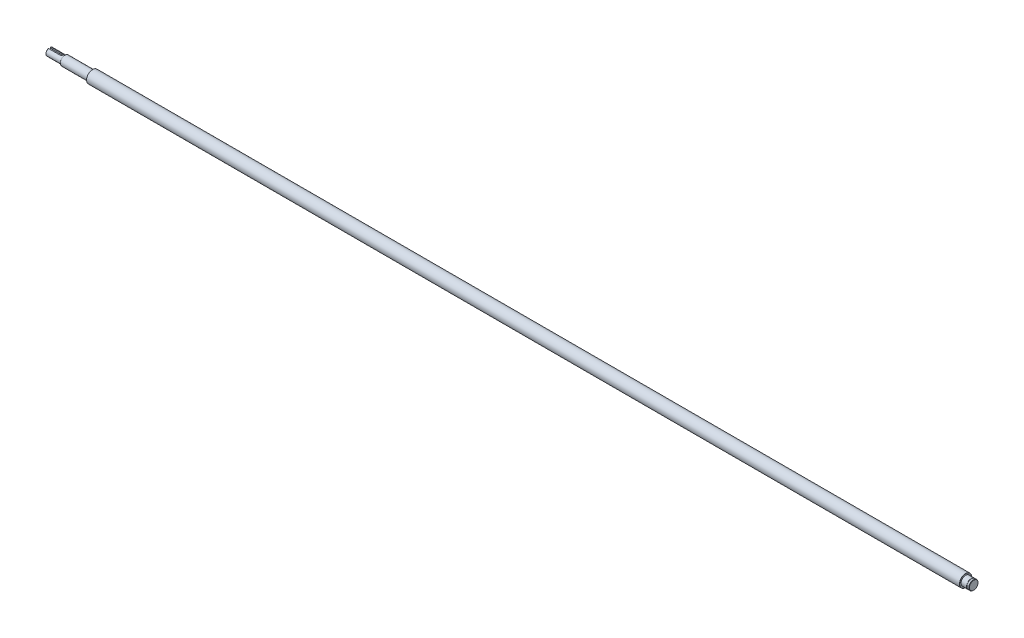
ISO-10303-21;
HEADER;
FILE_DESCRIPTION(('STEP AP214'),'2;1');
FILE_NAME('part.step','',(''),(''),'','','');
FILE_SCHEMA(('AUTOMOTIVE_DESIGN { 1 0 10303 214 1 1 1 1 }'));
ENDSEC;
DATA;
#1=APPLICATION_CONTEXT('core data for automotive mechanical design processes');
#2=APPLICATION_PROTOCOL_DEFINITION('international standard','automotive_design',2000,#1);
#3=PRODUCT_CONTEXT('',#1,'mechanical');
#4=PRODUCT('Part','Part','',(#3));
#5=PRODUCT_RELATED_PRODUCT_CATEGORY('part','',(#4));
#6=PRODUCT_DEFINITION_FORMATION('','',#4);
#7=PRODUCT_DEFINITION_CONTEXT('part definition',#1,'design');
#8=PRODUCT_DEFINITION('design','',#6,#7);
#9=PRODUCT_DEFINITION_SHAPE('','',#8);
#10=(LENGTH_UNIT() NAMED_UNIT(*) SI_UNIT(.MILLI.,.METRE.));
#11=(NAMED_UNIT(*) PLANE_ANGLE_UNIT() SI_UNIT($,.RADIAN.));
#12=(NAMED_UNIT(*) SI_UNIT($,.STERADIAN.) SOLID_ANGLE_UNIT());
#13=UNCERTAINTY_MEASURE_WITH_UNIT(LENGTH_MEASURE(1.E-05),#10,'distance_accuracy_value','');
#14=(GEOMETRIC_REPRESENTATION_CONTEXT(3) GLOBAL_UNCERTAINTY_ASSIGNED_CONTEXT((#13)) GLOBAL_UNIT_ASSIGNED_CONTEXT((#10,
#11,#12)) REPRESENTATION_CONTEXT('',''));
#15=CARTESIAN_POINT('',(0.,0.,0.));
#16=DIRECTION('',(0.,0.,1.));
#17=DIRECTION('',(1.,0.,0.));
#18=AXIS2_PLACEMENT_3D('',#15,#16,#17);
#19=CARTESIAN_POINT('',(0.,0.,0.));
#20=DIRECTION('',(1.,0.,0.));
#21=DIRECTION('',(0.,0.,-1.));
#22=AXIS2_PLACEMENT_3D('',#19,#20,#21);
#23=PLANE('',#22);
#24=DIRECTION('',(0.,-1.,0.));
#25=VECTOR('',#24,1.);
#26=CARTESIAN_POINT('',(0.,7.5,-2.));
#27=LINE('',#26,#25);
#28=CARTESIAN_POINT('',(0.,5.12347538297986,-2.));
#29=VERTEX_POINT('',#28);
#30=CARTESIAN_POINT('',(0.,3.5,-2.));
#31=VERTEX_POINT('',#30);
#32=EDGE_CURVE('E122',#29,#31,#27,.T.);
#33=ORIENTED_EDGE('',*,*,#32,.F.);
#34=CARTESIAN_POINT('',(0.,0.,0.));
#35=DIRECTION('',(1.,0.,0.));
#36=DIRECTION('',(0.,0.,-1.));
#37=AXIS2_PLACEMENT_3D('',#34,#35,#36);
#38=CIRCLE('',#37,5.50000000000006);
#39=CARTESIAN_POINT('',(0.,5.12347538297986,2.));
#40=VERTEX_POINT('',#39);
#41=EDGE_CURVE('E190',#29,#40,#38,.F.);
#42=ORIENTED_EDGE('',*,*,#41,.T.);
#43=DIRECTION('',(0.,-1.,0.));
#44=VECTOR('',#43,1.);
#45=CARTESIAN_POINT('',(0.,7.5,2.));
#46=LINE('',#45,#44);
#47=CARTESIAN_POINT('',(0.,3.5,2.));
#48=VERTEX_POINT('',#47);
#49=EDGE_CURVE('E81',#40,#48,#46,.T.);
#50=ORIENTED_EDGE('',*,*,#49,.T.);
#51=DIRECTION('',(0.,0.,1.));
#52=VECTOR('',#51,1.);
#53=CARTESIAN_POINT('',(0.,3.5,2.));
#54=LINE('',#53,#52);
#55=EDGE_CURVE('E131',#31,#48,#54,.T.);
#56=ORIENTED_EDGE('',*,*,#55,.F.);
#57=EDGE_LOOP('',(#33,#42,#50,#56));
#58=FACE_BOUND('',#57,.T.);
#59=ADVANCED_FACE('F58',(#58),#23,.F.);
#60=CARTESIAN_POINT('',(0.,0.,0.));
#61=DIRECTION('',(-1.,0.,0.));
#62=DIRECTION('',(0.,0.,1.));
#63=AXIS2_PLACEMENT_3D('',#60,#61,#62);
#64=CYLINDRICAL_SURFACE('',#63,6.);
#65=CARTESIAN_POINT('',(25.,0.,0.));
#66=DIRECTION('',(-1.,0.,0.));
#67=DIRECTION('',(0.,0.,1.));
#68=AXIS2_PLACEMENT_3D('',#65,#66,#67);
#69=CIRCLE('',#68,6.);
#70=CARTESIAN_POINT('',(25.,0.,6.));
#71=VERTEX_POINT('',#70);
#72=EDGE_CURVE('E178',#71,#71,#69,.T.);
#73=ORIENTED_EDGE('',*,*,#72,.T.);
#74=EDGE_LOOP('',(#73));
#75=FACE_BOUND('',#74,.T.);
#76=DIRECTION('',(-1.,0.,0.));
#77=VECTOR('',#76,1.);
#78=CARTESIAN_POINT('',(0.,5.65685424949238,-2.));
#79=LINE('',#78,#77);
#80=CARTESIAN_POINT('',(20.,5.65685424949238,-2.));
#81=VERTEX_POINT('',#80);
#82=CARTESIAN_POINT('',(0.49999999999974,5.65685424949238,-2.));
#83=VERTEX_POINT('',#82);
#84=EDGE_CURVE('E89',#81,#83,#79,.T.);
#85=ORIENTED_EDGE('',*,*,#84,.F.);
#86=CARTESIAN_POINT('',(20.,5.65685424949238,2.));
#87=CARTESIAN_POINT('',(20.0545809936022,5.65684884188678,2.0000014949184));
#88=CARTESIAN_POINT('',(20.1091341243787,5.6576451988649,1.99776424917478));
#89=CARTESIAN_POINT('',(20.2178171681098,5.66078654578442,1.9888512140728));
#90=CARTESIAN_POINT('',(20.2719471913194,5.66313111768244,1.98217662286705));
#91=CARTESIAN_POINT('',(20.4327842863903,5.67238184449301,1.95562135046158));
#92=CARTESIAN_POINT('',(20.538361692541,5.6815058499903,1.92920846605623));
#93=CARTESIAN_POINT('',(20.7432503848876,5.70456149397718,1.85991682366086));
#94=CARTESIAN_POINT('',(20.8425650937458,5.71849047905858,1.81704715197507));
#95=CARTESIAN_POINT('',(21.0326796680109,5.74957574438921,1.71614645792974));
#96=CARTESIAN_POINT('',(21.1234742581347,5.76673400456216,1.65810612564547));
#97=CARTESIAN_POINT('',(21.2974404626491,5.80308960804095,1.52610278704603));
#98=CARTESIAN_POINT('',(21.3802297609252,5.82233755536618,1.45164996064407));
#99=CARTESIAN_POINT('',(21.5324120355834,5.86027697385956,1.28997688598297));
#100=CARTESIAN_POINT('',(21.6018026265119,5.87896834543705,1.20275436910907));
#101=CARTESIAN_POINT('',(21.7269590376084,5.91427765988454,1.01520729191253));
#102=CARTESIAN_POINT('',(21.7823219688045,5.93082875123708,0.914600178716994));
#103=CARTESIAN_POINT('',(21.8751845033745,5.95939217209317,0.704858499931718));
#104=CARTESIAN_POINT('',(21.9126895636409,5.97140588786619,0.59572655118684));
#105=CARTESIAN_POINT('',(21.9674714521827,5.98918142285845,0.376058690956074));
#106=CARTESIAN_POINT('',(21.9854065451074,5.99514617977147,0.265703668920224));
#107=CARTESIAN_POINT('',(22.0026325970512,6.00087216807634,0.0433979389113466));
#108=CARTESIAN_POINT('',(22.0019279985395,6.00063487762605,-0.0685523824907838));
#109=CARTESIAN_POINT('',(21.9823114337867,5.99412077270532,-0.286207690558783));
#110=CARTESIAN_POINT('',(21.9641147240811,5.98808121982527,-0.391985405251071));
#111=CARTESIAN_POINT('',(21.9112136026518,5.97093921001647,-0.598888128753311));
#112=CARTESIAN_POINT('',(21.8765082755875,5.95983647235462,-0.700012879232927));
#113=CARTESIAN_POINT('',(21.7911572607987,5.93351336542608,-0.896305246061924));
#114=CARTESIAN_POINT('',(21.7403079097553,5.91824075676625,-0.991377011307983));
#115=CARTESIAN_POINT('',(21.6242800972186,5.88516775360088,-1.17184917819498));
#116=CARTESIAN_POINT('',(21.559097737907,5.86736667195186,-1.25724693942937));
#117=CARTESIAN_POINT('',(21.4126579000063,5.83012543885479,-1.42019467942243));
#118=CARTESIAN_POINT('',(21.3307889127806,5.81064757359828,-1.4971872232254));
#119=CARTESIAN_POINT('',(21.1551170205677,5.77294980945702,-1.63654404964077));
#120=CARTESIAN_POINT('',(21.0613102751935,5.75473031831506,-1.69890360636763));
#121=CARTESIAN_POINT('',(20.8626396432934,5.72140062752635,-1.80800665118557));
#122=CARTESIAN_POINT('',(20.7576329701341,5.70634029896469,-1.85450601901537));
#123=CARTESIAN_POINT('',(20.5407060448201,5.68162194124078,-1.92892046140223));
#124=CARTESIAN_POINT('',(20.4287970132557,5.67195538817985,-1.95686487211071));
#125=CARTESIAN_POINT('',(20.263162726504,5.6627308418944,-1.98331631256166));
#126=CARTESIAN_POINT('',(20.2107172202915,5.66053335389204,-1.98957012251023));
#127=CARTESIAN_POINT('',(20.1055238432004,5.65759407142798,-1.99790923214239));
#128=CARTESIAN_POINT('',(20.0527764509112,5.65685039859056,-1.99999991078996));
#129=CARTESIAN_POINT('',(20.,5.65685424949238,-2.));
#130=B_SPLINE_CURVE_WITH_KNOTS('',3,(#86,#87,#88,#89,#90,#91,#92,#93,#94,#95,#96,#97,#98,#99,
#100,#101,#102,#103,#104,#105,#106,#107,#108,#109,#110,#111,#112,#113,#114,#115,#116,#117,#118,
#119,#120,#121,#122,#123,#124,#125,#126,#127,#128,#129),.UNSPECIFIED.,.F.,.F.,(4,2,2,2,2,2,2,2,
2,2,2,2,2,2,2,2,2,2,2,2,2,4),(0.,0.163636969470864,0.327229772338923,0.653162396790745,
0.97891532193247,1.30486862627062,1.64233009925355,1.97985159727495,2.32618265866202,
2.67240782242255,3.00658941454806,3.34069136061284,3.6616883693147,3.98270317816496,
4.30794037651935,4.63326613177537,4.97388108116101,5.31460588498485,5.6603605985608,
6.00556734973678,6.16399790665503,6.32222363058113),.UNSPECIFIED.);
#131=CARTESIAN_POINT('',(20.,5.65685424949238,2.));
#132=VERTEX_POINT('',#131);
#133=EDGE_CURVE('E11',#132,#81,#130,.T.);
#134=ORIENTED_EDGE('',*,*,#133,.F.);
#135=DIRECTION('',(-1.,0.,0.));
#136=VECTOR('',#135,1.);
#137=CARTESIAN_POINT('',(0.,5.65685424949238,2.));
#138=LINE('',#137,#136);
#139=CARTESIAN_POINT('',(0.499999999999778,5.65685424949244,2.));
#140=VERTEX_POINT('',#139);
#141=EDGE_CURVE('E121',#140,#132,#138,.F.);
#142=ORIENTED_EDGE('',*,*,#141,.F.);
#143=CARTESIAN_POINT('',(0.499999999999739,0.,0.));
#144=DIRECTION('',(1.,0.,0.));
#145=DIRECTION('',(0.,0.,-1.));
#146=AXIS2_PLACEMENT_3D('',#143,#144,#145);
#147=CIRCLE('',#146,6.);
#148=EDGE_CURVE('E194',#140,#83,#147,.T.);
#149=ORIENTED_EDGE('',*,*,#148,.T.);
#150=EDGE_LOOP('',(#85,#134,#142,#149));
#151=FACE_BOUND('',#150,.T.);
#152=ADVANCED_FACE('F293',(#75,#151),#64,.T.);
#153=CARTESIAN_POINT('',(0.,0.,0.));
#154=DIRECTION('',(1.,0.,0.));
#155=DIRECTION('',(0.,0.,-1.));
#156=AXIS2_PLACEMENT_3D('',#153,#154,#155);
#157=CONICAL_SURFACE('',#156,5.50000000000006,0.78539816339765);
#158=ORIENTED_EDGE('',*,*,#41,.F.);
#159=CARTESIAN_POINT('',(-2.54970975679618,2.1689196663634,-2.));
#160=CARTESIAN_POINT('',(-2.50687100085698,2.22718211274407,-2.));
#161=CARTESIAN_POINT('',(-2.46352869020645,2.28507023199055,-2.));
#162=CARTESIAN_POINT('',(-2.37598237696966,2.40018577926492,-2.));
#163=CARTESIAN_POINT('',(-2.3317784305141,2.45741324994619,-2.));
#164=CARTESIAN_POINT('',(-2.19810593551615,2.62821957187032,-2.));
#165=CARTESIAN_POINT('',(-2.10755529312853,2.74095120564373,-2.));
#166=CARTESIAN_POINT('',(-1.92440883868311,2.9646183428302,-2.));
#167=CARTESIAN_POINT('',(-1.83181428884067,3.07555488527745,-2.));
#168=CARTESIAN_POINT('',(-1.64503153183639,3.29608923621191,-2.));
#169=CARTESIAN_POINT('',(-1.55084320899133,3.40568694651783,-2.));
#170=CARTESIAN_POINT('',(-1.26662100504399,3.7327223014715,-2.));
#171=CARTESIAN_POINT('',(-1.07477766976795,3.94858536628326,-2.));
#172=CARTESIAN_POINT('',(-0.688037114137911,4.37761368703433,-2.));
#173=CARTESIAN_POINT('',(-0.493139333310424,4.59077843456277,-2.));
#174=CARTESIAN_POINT('',(-0.0232059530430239,5.09984210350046,-2.));
#175=CARTESIAN_POINT('',(0.252800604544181,5.39484360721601,-2.));
#176=CARTESIAN_POINT('',(0.80723053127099,5.98251773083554,-2.));
#177=CARTESIAN_POINT('',(1.08565372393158,6.27519051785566,-2.));
#178=CARTESIAN_POINT('',(1.64436833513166,6.85924916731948,-2.));
#179=CARTESIAN_POINT('',(1.924661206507,7.1506336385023,-2.));
#180=CARTESIAN_POINT('',(2.4864216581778,7.73229198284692,-2.));
#181=CARTESIAN_POINT('',(2.76788928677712,8.02256580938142,-2.));
#182=CARTESIAN_POINT('',(3.04970975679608,8.31249282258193,-2.));
#183=B_SPLINE_CURVE_WITH_KNOTS('',3,(#159,#160,#161,#162,#163,#164,#165,#166,#167,#168,#169,
#170,#171,#172,#173,#174,#175,#176,#177,#178,#179,#180,#181,#182),.UNSPECIFIED.,.F.,.F.,(4,2,2,
2,2,2,2,2,2,2,2,4),(0.,0.216941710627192,0.433869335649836,0.867616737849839,1.30110338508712,
1.734621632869,2.60094376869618,3.46742677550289,4.67936170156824,5.89120885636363,
7.10414397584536,8.31712947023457),.UNSPECIFIED.);
#184=EDGE_CURVE('E74',#29,#83,#183,.T.);
#185=ORIENTED_EDGE('',*,*,#184,.T.);
#186=ORIENTED_EDGE('',*,*,#148,.F.);
#187=CARTESIAN_POINT('',(3.04970975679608,8.31249282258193,2.));
#188=CARTESIAN_POINT('',(2.80819906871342,8.06405921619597,2.));
#189=CARTESIAN_POINT('',(2.56696296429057,7.81535716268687,2.));
#190=CARTESIAN_POINT('',(2.08531903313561,7.31718828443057,2.));
#191=CARTESIAN_POINT('',(1.84491114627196,7.06772151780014,2.));
#192=CARTESIAN_POINT('',(1.36531735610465,6.56791539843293,2.));
#193=CARTESIAN_POINT('',(1.12613078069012,6.31757669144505,2.));
#194=CARTESIAN_POINT('',(0.649244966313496,5.81544541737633,2.));
#195=CARTESIAN_POINT('',(0.411545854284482,5.56365272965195,2.));
#196=CARTESIAN_POINT('',(-0.061877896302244,5.05778610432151,2.));
#197=CARTESIAN_POINT('',(-0.29760057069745,4.80371032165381,2.));
#198=CARTESIAN_POINT('',(-0.648590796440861,4.42026911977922,2.));
#199=CARTESIAN_POINT('',(-0.765143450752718,4.29208069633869,2.));
#200=CARTESIAN_POINT('',(-0.997146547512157,4.03470055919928,2.));
#201=CARTESIAN_POINT('',(-1.11259695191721,3.9055088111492,2.));
#202=CARTESIAN_POINT('',(-1.34215047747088,3.64573886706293,2.));
#203=CARTESIAN_POINT('',(-1.45625238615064,3.51515959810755,2.));
#204=CARTESIAN_POINT('',(-1.68251020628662,3.2523402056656,2.));
#205=CARTESIAN_POINT('',(-1.79466630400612,3.12010024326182,2.));
#206=CARTESIAN_POINT('',(-1.96091754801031,2.92001243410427,2.));
#207=CARTESIAN_POINT('',(-2.01602337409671,2.85300440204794,2.));
#208=CARTESIAN_POINT('',(-2.1254221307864,2.71833024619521,2.));
#209=CARTESIAN_POINT('',(-2.17971508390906,2.65066414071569,2.));
#210=CARTESIAN_POINT('',(-2.28734445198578,2.51453780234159,2.));
#211=CARTESIAN_POINT('',(-2.34068055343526,2.4460773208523,2.));
#212=CARTESIAN_POINT('',(-2.44615350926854,2.30822924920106,2.));
#213=CARTESIAN_POINT('',(-2.49829024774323,2.23884157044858,2.));
#214=CARTESIAN_POINT('',(-2.54970975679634,2.16891966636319,2.));
#215=B_SPLINE_CURVE_WITH_KNOTS('',3,(#187,#188,#189,#190,#191,#192,#193,#194,#195,#196,#197,
#198,#199,#200,#201,#202,#203,#204,#205,#206,#207,#208,#209,#210,#211,#212,#213,#214),
.UNSPECIFIED.,.F.,.F.,(4,2,2,2,2,2,2,2,2,2,2,2,2,4),(0.,1.03943393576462,2.0787907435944,
3.11749537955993,4.15628747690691,5.19601215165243,5.71576816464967,6.23554205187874,
6.7557523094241,7.27591249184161,7.53617761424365,7.79643551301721,8.05677718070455,
8.31714390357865),.UNSPECIFIED.);
#216=EDGE_CURVE('E222',#140,#40,#215,.T.);
#217=ORIENTED_EDGE('',*,*,#216,.T.);
#218=EDGE_LOOP('',(#158,#185,#186,#217));
#219=FACE_BOUND('',#218,.T.);
#220=ADVANCED_FACE('F236',(#219),#157,.T.);
#221=CARTESIAN_POINT('',(25.,6.,0.));
#222=DIRECTION('',(1.,0.,0.));
#223=DIRECTION('',(0.,0.,-1.));
#224=AXIS2_PLACEMENT_3D('',#221,#222,#223);
#225=PLANE('',#224);
#226=CARTESIAN_POINT('',(25.,0.,0.));
#227=DIRECTION('',(1.,0.,0.));
#228=DIRECTION('',(0.,0.,-1.));
#229=AXIS2_PLACEMENT_3D('',#226,#227,#228);
#230=CIRCLE('',#229,7.29999999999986);
#231=CARTESIAN_POINT('',(25.,0.,-7.29999999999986));
#232=VERTEX_POINT('',#231);
#233=EDGE_CURVE('E210',#232,#232,#230,.F.);
#234=ORIENTED_EDGE('',*,*,#233,.T.);
#235=EDGE_LOOP('',(#234));
#236=FACE_BOUND('',#235,.T.);
#237=ORIENTED_EDGE('',*,*,#72,.F.);
#238=EDGE_LOOP('',(#237));
#239=FACE_BOUND('',#238,.T.);
#240=ADVANCED_FACE('F289',(#236,#239),#225,.F.);
#241=CARTESIAN_POINT('',(0.,0.,0.));
#242=DIRECTION('',(-1.,0.,0.));
#243=DIRECTION('',(0.,0.,1.));
#244=AXIS2_PLACEMENT_3D('',#241,#242,#243);
#245=CYLINDRICAL_SURFACE('',#244,7.5);
#246=CARTESIAN_POINT('',(25.2000000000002,0.,0.));
#247=DIRECTION('',(1.,0.,0.));
#248=DIRECTION('',(0.,0.,-1.));
#249=AXIS2_PLACEMENT_3D('',#246,#247,#248);
#250=CIRCLE('',#249,7.5);
#251=CARTESIAN_POINT('',(25.2000000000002,0.,-7.5));
#252=VERTEX_POINT('',#251);
#253=EDGE_CURVE('E214',#252,#252,#250,.T.);
#254=ORIENTED_EDGE('',*,*,#253,.T.);
#255=EDGE_LOOP('',(#254));
#256=FACE_BOUND('',#255,.T.);
#257=CARTESIAN_POINT('',(70.,0.,0.));
#258=DIRECTION('',(-1.,0.,0.));
#259=DIRECTION('',(0.,0.,1.));
#260=AXIS2_PLACEMENT_3D('',#257,#258,#259);
#261=CIRCLE('',#260,7.5);
#262=CARTESIAN_POINT('',(70.,0.,7.5));
#263=VERTEX_POINT('',#262);
#264=EDGE_CURVE('E174',#263,#263,#261,.T.);
#265=ORIENTED_EDGE('',*,*,#264,.T.);
#266=EDGE_LOOP('',(#265));
#267=FACE_BOUND('',#266,.T.);
#268=ADVANCED_FACE('F285',(#256,#267),#245,.T.);
#269=CARTESIAN_POINT('',(70.,7.5,0.));
#270=DIRECTION('',(1.,0.,0.));
#271=DIRECTION('',(0.,0.,-1.));
#272=AXIS2_PLACEMENT_3D('',#269,#270,#271);
#273=PLANE('',#272);
#274=CARTESIAN_POINT('',(70.,0.,0.));
#275=DIRECTION('',(1.,0.,0.));
#276=DIRECTION('',(0.,0.,-1.));
#277=AXIS2_PLACEMENT_3D('',#274,#275,#276);
#278=CIRCLE('',#277,9.70000000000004);
#279=CARTESIAN_POINT('',(70.,0.,-9.70000000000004));
#280=VERTEX_POINT('',#279);
#281=EDGE_CURVE('E198',#280,#280,#278,.F.);
#282=ORIENTED_EDGE('',*,*,#281,.T.);
#283=EDGE_LOOP('',(#282));
#284=FACE_BOUND('',#283,.T.);
#285=ORIENTED_EDGE('',*,*,#264,.F.);
#286=EDGE_LOOP('',(#285));
#287=FACE_BOUND('',#286,.T.);
#288=ADVANCED_FACE('F281',(#284,#287),#273,.F.);
#289=CARTESIAN_POINT('',(0.,0.,0.));
#290=DIRECTION('',(-1.,0.,0.));
#291=DIRECTION('',(0.,0.,1.));
#292=AXIS2_PLACEMENT_3D('',#289,#290,#291);
#293=CYLINDRICAL_SURFACE('',#292,9.9);
#294=CARTESIAN_POINT('',(70.1999999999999,0.,0.));
#295=DIRECTION('',(1.,0.,0.));
#296=DIRECTION('',(0.,0.,-1.));
#297=AXIS2_PLACEMENT_3D('',#294,#295,#296);
#298=CIRCLE('',#297,9.9);
#299=CARTESIAN_POINT('',(70.1999999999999,0.,9.9));
#300=VERTEX_POINT('',#299);
#301=EDGE_CURVE('E206',#300,#300,#298,.T.);
#302=CARTESIAN_POINT('',(1486.8,0.,0.));
#303=DIRECTION('',(-1.,0.,0.));
#304=DIRECTION('',(0.,0.,1.));
#305=AXIS2_PLACEMENT_3D('',#302,#303,#304);
#306=CIRCLE('',#305,9.9);
#307=CARTESIAN_POINT('',(1486.8,0.,9.9));
#308=VERTEX_POINT('',#307);
#309=EDGE_CURVE('E202',#308,#308,#306,.T.);
#310=CARTESIAN_POINT('',(70.1999999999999,0.,9.9));
#311=CARTESIAN_POINT('',(84.9562499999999,0.,9.9));
#312=CARTESIAN_POINT('',(99.7124999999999,0.,9.9));
#313=CARTESIAN_POINT('',(129.225,0.,9.9));
#314=CARTESIAN_POINT('',(143.98125,0.,9.9));
#315=CARTESIAN_POINT('',(173.49375,0.,9.9));
#316=CARTESIAN_POINT('',(188.25,0.,9.9));
#317=CARTESIAN_POINT('',(217.7625,0.,9.9));
#318=CARTESIAN_POINT('',(232.51875,0.,9.9));
#319=CARTESIAN_POINT('',(262.03125,0.,9.9));
#320=CARTESIAN_POINT('',(276.7875,0.,9.9));
#321=CARTESIAN_POINT('',(306.3,0.,9.9));
#322=CARTESIAN_POINT('',(321.05625,0.,9.9));
#323=CARTESIAN_POINT('',(350.56875,0.,9.9));
#324=CARTESIAN_POINT('',(365.325,0.,9.9));
#325=CARTESIAN_POINT('',(394.8375,0.,9.9));
#326=CARTESIAN_POINT('',(409.59375,0.,9.9));
#327=CARTESIAN_POINT('',(439.10625,0.,9.9));
#328=CARTESIAN_POINT('',(453.8625,0.,9.9));
#329=CARTESIAN_POINT('',(483.375,0.,9.9));
#330=CARTESIAN_POINT('',(498.13125,0.,9.9));
#331=CARTESIAN_POINT('',(527.64375,0.,9.9));
#332=CARTESIAN_POINT('',(542.4,0.,9.9));
#333=CARTESIAN_POINT('',(571.9125,0.,9.9));
#334=CARTESIAN_POINT('',(586.66875,0.,9.9));
#335=CARTESIAN_POINT('',(616.18125,0.,9.9));
#336=CARTESIAN_POINT('',(630.9375,0.,9.9));
#337=CARTESIAN_POINT('',(660.45,0.,9.9));
#338=CARTESIAN_POINT('',(675.20625,0.,9.9));
#339=CARTESIAN_POINT('',(704.71875,0.,9.9));
#340=CARTESIAN_POINT('',(719.475,0.,9.9));
#341=CARTESIAN_POINT('',(748.9875,0.,9.9));
#342=CARTESIAN_POINT('',(763.74375,0.,9.9));
#343=CARTESIAN_POINT('',(793.25625,0.,9.9));
#344=CARTESIAN_POINT('',(808.0125,0.,9.9));
#345=CARTESIAN_POINT('',(837.525,0.,9.9));
#346=CARTESIAN_POINT('',(852.28125,0.,9.9));
#347=CARTESIAN_POINT('',(881.79375,0.,9.9));
#348=CARTESIAN_POINT('',(896.55,0.,9.9));
#349=CARTESIAN_POINT('',(926.0625,0.,9.9));
#350=CARTESIAN_POINT('',(940.81875,0.,9.9));
#351=CARTESIAN_POINT('',(970.33125,0.,9.9));
#352=CARTESIAN_POINT('',(985.0875,0.,9.9));
#353=CARTESIAN_POINT('',(1014.6,0.,9.9));
#354=CARTESIAN_POINT('',(1029.35625,0.,9.9));
#355=CARTESIAN_POINT('',(1058.86875,0.,9.9));
#356=CARTESIAN_POINT('',(1073.625,0.,9.9));
#357=CARTESIAN_POINT('',(1103.1375,0.,9.9));
#358=CARTESIAN_POINT('',(1117.89375,0.,9.9));
#359=CARTESIAN_POINT('',(1147.40625,0.,9.9));
#360=CARTESIAN_POINT('',(1162.1625,0.,9.9));
#361=CARTESIAN_POINT('',(1191.675,0.,9.9));
#362=CARTESIAN_POINT('',(1206.43125,0.,9.9));
#363=CARTESIAN_POINT('',(1235.94375,0.,9.9));
#364=CARTESIAN_POINT('',(1250.7,0.,9.9));
#365=CARTESIAN_POINT('',(1280.2125,0.,9.9));
#366=CARTESIAN_POINT('',(1294.96875,0.,9.9));
#367=CARTESIAN_POINT('',(1324.48125,0.,9.9));
#368=CARTESIAN_POINT('',(1339.2375,0.,9.9));
#369=CARTESIAN_POINT('',(1368.75,0.,9.9));
#370=CARTESIAN_POINT('',(1383.50625,0.,9.9));
#371=CARTESIAN_POINT('',(1413.01875,0.,9.9));
#372=CARTESIAN_POINT('',(1427.775,0.,9.9));
#373=CARTESIAN_POINT('',(1457.2875,0.,9.9));
#374=CARTESIAN_POINT('',(1472.04375,0.,9.9));
#375=CARTESIAN_POINT('',(1486.8,0.,9.9));
#376=B_SPLINE_CURVE_WITH_KNOTS('',3,(#310,#311,#312,#313,#314,#315,#316,#317,#318,#319,#320,
#321,#322,#323,#324,#325,#326,#327,#328,#329,#330,#331,#332,#333,#334,#335,#336,#337,#338,#339,
#340,#341,#342,#343,#344,#345,#346,#347,#348,#349,#350,#351,#352,#353,#354,#355,#356,#357,#358,
#359,#360,#361,#362,#363,#364,#365,#366,#367,#368,#369,#370,#371,#372,#373,#374,#375),
.UNSPECIFIED.,.F.,.F.,(4,2,2,2,2,2,2,2,2,2,2,2,2,2,2,2,2,2,2,2,2,2,2,2,2,2,2,2,2,2,2,2,4),(0.,
44.26875,88.5375,132.80625,177.075,221.34375,265.6125,309.88125,354.15,398.41875,442.6875,
486.95625,531.225,575.49375,619.7625,664.03125,708.3,752.56875,796.8375,841.10625,885.375,
929.64375,973.9125,1018.18125,1062.45,1106.71875,1150.9875,1195.25625,1239.525,1283.79375,
1328.0625,1372.33125,1416.6),.UNSPECIFIED.);
#377=EDGE_CURVE('BSEAM277',#300,#308,#376,.T.);
#378=ORIENTED_EDGE('',*,*,#301,.T.);
#379=ORIENTED_EDGE('',*,*,#309,.T.);
#380=ORIENTED_EDGE('',*,*,#377,.T.);
#381=ORIENTED_EDGE('',*,*,#377,.F.);
#382=EDGE_LOOP('',(#378,#380,#379,#381));
#383=FACE_BOUND('',#382,.T.);
#384=ADVANCED_FACE('F277',(#383),#293,.T.);
#385=CARTESIAN_POINT('',(1487.,9.9,0.));
#386=DIRECTION('',(-1.,0.,0.));
#387=DIRECTION('',(0.,0.,1.));
#388=AXIS2_PLACEMENT_3D('',#385,#386,#387);
#389=PLANE('',#388);
#390=CARTESIAN_POINT('',(1487.,0.,0.));
#391=DIRECTION('',(-1.,0.,0.));
#392=DIRECTION('',(0.,0.,1.));
#393=AXIS2_PLACEMENT_3D('',#390,#391,#392);
#394=CIRCLE('',#393,9.70000000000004);
#395=CARTESIAN_POINT('',(1487.,0.,9.69999999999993));
#396=VERTEX_POINT('',#395);
#397=EDGE_CURVE('E218',#396,#396,#394,.F.);
#398=ORIENTED_EDGE('',*,*,#397,.T.);
#399=EDGE_LOOP('',(#398));
#400=FACE_BOUND('',#399,.T.);
#401=CARTESIAN_POINT('',(1487.,0.,0.));
#402=DIRECTION('',(-1.,0.,0.));
#403=DIRECTION('',(0.,0.,1.));
#404=AXIS2_PLACEMENT_3D('',#401,#402,#403);
#405=CIRCLE('',#404,7.5);
#406=CARTESIAN_POINT('',(1487.,0.,7.5));
#407=VERTEX_POINT('',#406);
#408=EDGE_CURVE('E170',#407,#407,#405,.T.);
#409=ORIENTED_EDGE('',*,*,#408,.T.);
#410=EDGE_LOOP('',(#409));
#411=FACE_BOUND('',#410,.T.);
#412=ADVANCED_FACE('F273',(#400,#411),#389,.F.);
#413=CARTESIAN_POINT('',(0.,0.,0.));
#414=DIRECTION('',(-1.,0.,0.));
#415=DIRECTION('',(0.,0.,1.));
#416=AXIS2_PLACEMENT_3D('',#413,#414,#415);
#417=CYLINDRICAL_SURFACE('',#416,7.5);
#418=ORIENTED_EDGE('',*,*,#408,.F.);
#419=EDGE_LOOP('',(#418));
#420=FACE_BOUND('',#419,.T.);
#421=CARTESIAN_POINT('',(1496.,0.,0.));
#422=DIRECTION('',(-1.,0.,0.));
#423=DIRECTION('',(0.,0.,1.));
#424=AXIS2_PLACEMENT_3D('',#421,#422,#423);
#425=CIRCLE('',#424,7.5);
#426=CARTESIAN_POINT('',(1496.,0.,7.5));
#427=VERTEX_POINT('',#426);
#428=EDGE_CURVE('E166',#427,#427,#425,.T.);
#429=ORIENTED_EDGE('',*,*,#428,.T.);
#430=EDGE_LOOP('',(#429));
#431=FACE_BOUND('',#430,.T.);
#432=ADVANCED_FACE('F269',(#420,#431),#417,.T.);
#433=CARTESIAN_POINT('',(1496.,7.15,0.));
#434=DIRECTION('',(-1.,0.,0.));
#435=DIRECTION('',(0.,0.,1.));
#436=AXIS2_PLACEMENT_3D('',#433,#434,#435);
#437=PLANE('',#436);
#438=ORIENTED_EDGE('',*,*,#428,.F.);
#439=EDGE_LOOP('',(#438));
#440=FACE_BOUND('',#439,.T.);
#441=CARTESIAN_POINT('',(1496.,0.,0.));
#442=DIRECTION('',(-1.,0.,0.));
#443=DIRECTION('',(0.,0.,1.));
#444=AXIS2_PLACEMENT_3D('',#441,#442,#443);
#445=CIRCLE('',#444,7.15);
#446=CARTESIAN_POINT('',(1496.,0.,7.15));
#447=VERTEX_POINT('',#446);
#448=EDGE_CURVE('E162',#447,#447,#445,.T.);
#449=ORIENTED_EDGE('',*,*,#448,.T.);
#450=EDGE_LOOP('',(#449));
#451=FACE_BOUND('',#450,.T.);
#452=ADVANCED_FACE('F265',(#440,#451),#437,.F.);
#453=CARTESIAN_POINT('',(0.,0.,0.));
#454=DIRECTION('',(-1.,0.,0.));
#455=DIRECTION('',(0.,0.,1.));
#456=AXIS2_PLACEMENT_3D('',#453,#454,#455);
#457=CYLINDRICAL_SURFACE('',#456,7.15);
#458=ORIENTED_EDGE('',*,*,#448,.F.);
#459=EDGE_LOOP('',(#458));
#460=FACE_BOUND('',#459,.T.);
#461=CARTESIAN_POINT('',(1497.15,0.,0.));
#462=DIRECTION('',(-1.,0.,0.));
#463=DIRECTION('',(0.,0.,1.));
#464=AXIS2_PLACEMENT_3D('',#461,#462,#463);
#465=CIRCLE('',#464,7.15);
#466=CARTESIAN_POINT('',(1497.15,0.,7.15));
#467=VERTEX_POINT('',#466);
#468=EDGE_CURVE('E158',#467,#467,#465,.T.);
#469=ORIENTED_EDGE('',*,*,#468,.T.);
#470=EDGE_LOOP('',(#469));
#471=FACE_BOUND('',#470,.T.);
#472=ADVANCED_FACE('F261',(#460,#471),#457,.T.);
#473=CARTESIAN_POINT('',(1497.15,7.5,0.));
#474=DIRECTION('',(1.,0.,0.));
#475=DIRECTION('',(0.,0.,-1.));
#476=AXIS2_PLACEMENT_3D('',#473,#474,#475);
#477=PLANE('',#476);
#478=ORIENTED_EDGE('',*,*,#468,.F.);
#479=EDGE_LOOP('',(#478));
#480=FACE_BOUND('',#479,.T.);
#481=CARTESIAN_POINT('',(1497.15,0.,0.));
#482=DIRECTION('',(-1.,0.,0.));
#483=DIRECTION('',(0.,0.,1.));
#484=AXIS2_PLACEMENT_3D('',#481,#482,#483);
#485=CIRCLE('',#484,7.5);
#486=CARTESIAN_POINT('',(1497.15,0.,7.5));
#487=VERTEX_POINT('',#486);
#488=EDGE_CURVE('E154',#487,#487,#485,.T.);
#489=ORIENTED_EDGE('',*,*,#488,.T.);
#490=EDGE_LOOP('',(#489));
#491=FACE_BOUND('',#490,.T.);
#492=ADVANCED_FACE('F257',(#480,#491),#477,.F.);
#493=CARTESIAN_POINT('',(0.,0.,0.));
#494=DIRECTION('',(-1.,0.,0.));
#495=DIRECTION('',(0.,0.,1.));
#496=AXIS2_PLACEMENT_3D('',#493,#494,#495);
#497=CYLINDRICAL_SURFACE('',#496,7.5);
#498=CARTESIAN_POINT('',(1499.5,0.,0.));
#499=DIRECTION('',(-1.,0.,0.));
#500=DIRECTION('',(0.,0.,1.));
#501=AXIS2_PLACEMENT_3D('',#498,#499,#500);
#502=CIRCLE('',#501,7.5);
#503=CARTESIAN_POINT('',(1499.5,0.,7.5));
#504=VERTEX_POINT('',#503);
#505=EDGE_CURVE('E182',#504,#504,#502,.T.);
#506=ORIENTED_EDGE('',*,*,#505,.T.);
#507=EDGE_LOOP('',(#506));
#508=FACE_BOUND('',#507,.T.);
#509=ORIENTED_EDGE('',*,*,#488,.F.);
#510=EDGE_LOOP('',(#509));
#511=FACE_BOUND('',#510,.T.);
#512=ADVANCED_FACE('F253',(#508,#511),#497,.T.);
#513=CARTESIAN_POINT('',(1500.,7.5,0.));
#514=DIRECTION('',(-1.,0.,0.));
#515=DIRECTION('',(0.,0.,1.));
#516=AXIS2_PLACEMENT_3D('',#513,#514,#515);
#517=PLANE('',#516);
#518=CARTESIAN_POINT('',(1500.,0.,0.));
#519=DIRECTION('',(-1.,0.,0.));
#520=DIRECTION('',(0.,0.,1.));
#521=AXIS2_PLACEMENT_3D('',#518,#519,#520);
#522=CIRCLE('',#521,6.99999999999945);
#523=CARTESIAN_POINT('',(1500.,0.,6.99999999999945));
#524=VERTEX_POINT('',#523);
#525=EDGE_CURVE('E186',#524,#524,#522,.F.);
#526=ORIENTED_EDGE('',*,*,#525,.T.);
#527=EDGE_LOOP('',(#526));
#528=FACE_BOUND('',#527,.T.);
#529=ADVANCED_FACE('F249',(#528),#517,.F.);
#530=CARTESIAN_POINT('',(1499.5,0.,0.));
#531=DIRECTION('',(-1.,0.,0.));
#532=DIRECTION('',(0.,0.,1.));
#533=AXIS2_PLACEMENT_3D('',#530,#531,#532);
#534=CONICAL_SURFACE('',#533,7.5,0.785398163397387);
#535=ORIENTED_EDGE('',*,*,#525,.F.);
#536=EDGE_LOOP('',(#535));
#537=FACE_BOUND('',#536,.T.);
#538=ORIENTED_EDGE('',*,*,#505,.F.);
#539=EDGE_LOOP('',(#538));
#540=FACE_BOUND('',#539,.T.);
#541=ADVANCED_FACE('F252',(#537,#540),#534,.T.);
#542=CARTESIAN_POINT('',(70.,0.,0.));
#543=DIRECTION('',(1.,0.,0.));
#544=DIRECTION('',(0.,0.,-1.));
#545=AXIS2_PLACEMENT_3D('',#542,#543,#544);
#546=CONICAL_SURFACE('',#545,9.70000000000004,0.785398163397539);
#547=ORIENTED_EDGE('',*,*,#301,.F.);
#548=EDGE_LOOP('',(#547));
#549=FACE_BOUND('',#548,.T.);
#550=ORIENTED_EDGE('',*,*,#281,.F.);
#551=EDGE_LOOP('',(#550));
#552=FACE_BOUND('',#551,.T.);
#553=ADVANCED_FACE('F304',(#549,#552),#546,.T.);
#554=CARTESIAN_POINT('',(25.,0.,0.));
#555=DIRECTION('',(1.,0.,0.));
#556=DIRECTION('',(0.,0.,-1.));
#557=AXIS2_PLACEMENT_3D('',#554,#555,#556);
#558=CONICAL_SURFACE('',#557,7.29999999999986,0.785398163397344);
#559=ORIENTED_EDGE('',*,*,#253,.F.);
#560=EDGE_LOOP('',(#559));
#561=FACE_BOUND('',#560,.T.);
#562=ORIENTED_EDGE('',*,*,#233,.F.);
#563=EDGE_LOOP('',(#562));
#564=FACE_BOUND('',#563,.T.);
#565=ADVANCED_FACE('F309',(#561,#564),#558,.T.);
#566=CARTESIAN_POINT('',(1486.8,0.,0.));
#567=DIRECTION('',(-1.,0.,0.));
#568=DIRECTION('',(0.,0.,1.));
#569=AXIS2_PLACEMENT_3D('',#566,#567,#568);
#570=CONICAL_SURFACE('',#569,9.9,0.785398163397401);
#571=CARTESIAN_POINT('',(1487.,0.,9.69999999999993));
#572=CARTESIAN_POINT('',(1486.99791666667,0.,9.70208333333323));
#573=CARTESIAN_POINT('',(1486.99583333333,0.,9.70416666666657));
#574=CARTESIAN_POINT('',(1486.99166666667,0.,9.70833333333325));
#575=CARTESIAN_POINT('',(1486.98958333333,0.,9.71041666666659));
#576=CARTESIAN_POINT('',(1486.98541666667,0.,9.71458333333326));
#577=CARTESIAN_POINT('',(1486.98333333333,0.,9.71666666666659));
#578=CARTESIAN_POINT('',(1486.97916666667,0.,9.72083333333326));
#579=CARTESIAN_POINT('',(1486.97708333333,0.,9.72291666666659));
#580=CARTESIAN_POINT('',(1486.97291666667,0.,9.72708333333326));
#581=CARTESIAN_POINT('',(1486.97083333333,0.,9.72916666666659));
#582=CARTESIAN_POINT('',(1486.96666666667,0.,9.73333333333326));
#583=CARTESIAN_POINT('',(1486.96458333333,0.,9.73541666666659));
#584=CARTESIAN_POINT('',(1486.96041666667,0.,9.73958333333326));
#585=CARTESIAN_POINT('',(1486.95833333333,0.,9.74166666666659));
#586=CARTESIAN_POINT('',(1486.95416666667,0.,9.74583333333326));
#587=CARTESIAN_POINT('',(1486.95208333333,0.,9.74791666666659));
#588=CARTESIAN_POINT('',(1486.94791666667,0.,9.75208333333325));
#589=CARTESIAN_POINT('',(1486.94583333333,0.,9.75416666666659));
#590=CARTESIAN_POINT('',(1486.94166666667,0.,9.75833333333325));
#591=CARTESIAN_POINT('',(1486.93958333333,0.,9.76041666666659));
#592=CARTESIAN_POINT('',(1486.93541666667,0.,9.76458333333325));
#593=CARTESIAN_POINT('',(1486.93333333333,0.,9.76666666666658));
#594=CARTESIAN_POINT('',(1486.92916666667,0.,9.77083333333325));
#595=CARTESIAN_POINT('',(1486.92708333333,0.,9.77291666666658));
#596=CARTESIAN_POINT('',(1486.92291666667,0.,9.77708333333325));
#597=CARTESIAN_POINT('',(1486.92083333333,0.,9.77916666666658));
#598=CARTESIAN_POINT('',(1486.91666666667,0.,9.78333333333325));
#599=CARTESIAN_POINT('',(1486.91458333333,0.,9.78541666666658));
#600=CARTESIAN_POINT('',(1486.91041666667,0.,9.78958333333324));
#601=CARTESIAN_POINT('',(1486.90833333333,0.,9.79166666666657));
#602=CARTESIAN_POINT('',(1486.90416666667,0.,9.79583333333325));
#603=CARTESIAN_POINT('',(1486.90208333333,0.,9.7979166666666));
#604=CARTESIAN_POINT('',(1486.89791666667,0.,9.80208333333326));
#605=CARTESIAN_POINT('',(1486.89583333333,0.,9.80416666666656));
#606=CARTESIAN_POINT('',(1486.89166666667,0.,9.80833333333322));
#607=CARTESIAN_POINT('',(1486.88958333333,0.,9.81041666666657));
#608=CARTESIAN_POINT('',(1486.88541666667,0.,9.81458333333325));
#609=CARTESIAN_POINT('',(1486.88333333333,0.,9.81666666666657));
#610=CARTESIAN_POINT('',(1486.87916666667,0.,9.82083333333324));
#611=CARTESIAN_POINT('',(1486.87708333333,0.,9.82291666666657));
#612=CARTESIAN_POINT('',(1486.87291666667,0.,9.82708333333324));
#613=CARTESIAN_POINT('',(1486.87083333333,0.,9.82916666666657));
#614=CARTESIAN_POINT('',(1486.86666666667,0.,9.83333333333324));
#615=CARTESIAN_POINT('',(1486.86458333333,0.,9.83541666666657));
#616=CARTESIAN_POINT('',(1486.86041666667,0.,9.83958333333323));
#617=CARTESIAN_POINT('',(1486.85833333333,0.,9.84166666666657));
#618=CARTESIAN_POINT('',(1486.85416666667,0.,9.84583333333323));
#619=CARTESIAN_POINT('',(1486.85208333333,0.,9.84791666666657));
#620=CARTESIAN_POINT('',(1486.84791666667,0.,9.85208333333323));
#621=CARTESIAN_POINT('',(1486.84583333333,0.,9.85416666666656));
#622=CARTESIAN_POINT('',(1486.84166666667,0.,9.85833333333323));
#623=CARTESIAN_POINT('',(1486.83958333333,0.,9.86041666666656));
#624=CARTESIAN_POINT('',(1486.83541666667,0.,9.86458333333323));
#625=CARTESIAN_POINT('',(1486.83333333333,0.,9.86666666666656));
#626=CARTESIAN_POINT('',(1486.82916666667,0.,9.87083333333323));
#627=CARTESIAN_POINT('',(1486.82708333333,0.,9.87291666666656));
#628=CARTESIAN_POINT('',(1486.82291666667,0.,9.87708333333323));
#629=CARTESIAN_POINT('',(1486.82083333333,0.,9.87916666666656));
#630=CARTESIAN_POINT('',(1486.81666666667,0.,9.88333333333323));
#631=CARTESIAN_POINT('',(1486.81458333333,0.,9.88541666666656));
#632=CARTESIAN_POINT('',(1486.81041666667,0.,9.88958333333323));
#633=CARTESIAN_POINT('',(1486.80833333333,0.,9.89166666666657));
#634=CARTESIAN_POINT('',(1486.80416666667,0.,9.89583333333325));
#635=CARTESIAN_POINT('',(1486.80208333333,0.,9.89791666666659));
#636=CARTESIAN_POINT('',(1486.8,0.,9.89999999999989));
#637=B_SPLINE_CURVE_WITH_KNOTS('',3,(#571,#572,#573,#574,#575,#576,#577,#578,#579,#580,#581,
#582,#583,#584,#585,#586,#587,#588,#589,#590,#591,#592,#593,#594,#595,#596,#597,#598,#599,#600,
#601,#602,#603,#604,#605,#606,#607,#608,#609,#610,#611,#612,#613,#614,#615,#616,#617,#618,#619,
#620,#621,#622,#623,#624,#625,#626,#627,#628,#629,#630,#631,#632,#633,#634,#635,#636),
.UNSPECIFIED.,.F.,.F.,(4,2,2,2,2,2,2,2,2,2,2,2,2,2,2,2,2,2,2,2,2,2,2,2,2,2,2,2,2,2,2,2,4),(0.,
0.00883883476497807,0.0176776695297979,0.026516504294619,0.03535533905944,0.0441941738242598,
0.0530330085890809,0.061871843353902,0.0707106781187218,0.0795495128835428,0.0883883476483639,
0.0972271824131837,0.106066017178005,0.114904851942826,0.123743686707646,0.132582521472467,
0.141421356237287,0.150260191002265,0.159099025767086,0.167937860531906,0.176776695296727,
0.185615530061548,0.194454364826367,0.203293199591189,0.21213203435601,0.220970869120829,
0.22980970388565,0.238648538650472,0.247487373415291,0.256326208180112,0.265165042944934,
0.274003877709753,0.282842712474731),.UNSPECIFIED.);
#638=EDGE_CURVE('BSEAM61',#396,#308,#637,.T.);
#639=ORIENTED_EDGE('',*,*,#397,.F.);
#640=ORIENTED_EDGE('',*,*,#309,.F.);
#641=ORIENTED_EDGE('',*,*,#638,.T.);
#642=ORIENTED_EDGE('',*,*,#638,.F.);
#643=EDGE_LOOP('',(#639,#641,#640,#642));
#644=FACE_BOUND('',#643,.T.);
#645=ADVANCED_FACE('F61',(#644),#570,.T.);
#646=CARTESIAN_POINT('',(20.,7.5,0.));
#647=DIRECTION('',(0.,-1.,0.));
#648=DIRECTION('',(0.,0.,-1.));
#649=AXIS2_PLACEMENT_3D('',#646,#647,#648);
#650=CYLINDRICAL_SURFACE('',#649,2.);
#651=ORIENTED_EDGE('',*,*,#133,.T.);
#652=DIRECTION('',(0.,-1.,0.));
#653=VECTOR('',#652,1.);
#654=CARTESIAN_POINT('',(20.,7.5,-2.));
#655=LINE('',#654,#653);
#656=CARTESIAN_POINT('',(20.,3.5,-2.));
#657=VERTEX_POINT('',#656);
#658=EDGE_CURVE('E113',#81,#657,#655,.T.);
#659=ORIENTED_EDGE('',*,*,#658,.T.);
#660=CARTESIAN_POINT('',(20.,3.5,0.));
#661=DIRECTION('',(0.,1.,0.));
#662=DIRECTION('',(0.,0.,1.));
#663=AXIS2_PLACEMENT_3D('',#660,#661,#662);
#664=CIRCLE('',#663,2.);
#665=CARTESIAN_POINT('',(20.,3.5,2.));
#666=VERTEX_POINT('',#665);
#667=EDGE_CURVE('E118',#666,#657,#664,.T.);
#668=ORIENTED_EDGE('',*,*,#667,.F.);
#669=DIRECTION('',(0.,-1.,0.));
#670=VECTOR('',#669,1.);
#671=CARTESIAN_POINT('',(20.,7.5,2.));
#672=LINE('',#671,#670);
#673=EDGE_CURVE('E143',#132,#666,#672,.T.);
#674=ORIENTED_EDGE('',*,*,#673,.F.);
#675=EDGE_LOOP('',(#651,#659,#668,#674));
#676=FACE_BOUND('',#675,.T.);
#677=ADVANCED_FACE('F115',(#676),#650,.F.);
#678=CARTESIAN_POINT('',(0.,7.5,-2.));
#679=DIRECTION('',(0.,0.,1.));
#680=DIRECTION('',(1.,0.,0.));
#681=AXIS2_PLACEMENT_3D('',#678,#679,#680);
#682=PLANE('',#681);
#683=ORIENTED_EDGE('',*,*,#84,.T.);
#684=ORIENTED_EDGE('',*,*,#184,.F.);
#685=ORIENTED_EDGE('',*,*,#32,.T.);
#686=DIRECTION('',(-1.,0.,0.));
#687=VECTOR('',#686,1.);
#688=CARTESIAN_POINT('',(0.,3.5,-2.));
#689=LINE('',#688,#687);
#690=EDGE_CURVE('E125',#657,#31,#689,.T.);
#691=ORIENTED_EDGE('',*,*,#690,.F.);
#692=ORIENTED_EDGE('',*,*,#658,.F.);
#693=EDGE_LOOP('',(#683,#684,#685,#691,#692));
#694=FACE_BOUND('',#693,.T.);
#695=ADVANCED_FACE('F126',(#694),#682,.T.);
#696=CARTESIAN_POINT('',(0.,7.5,2.));
#697=DIRECTION('',(0.,0.,-1.));
#698=DIRECTION('',(-1.,0.,0.));
#699=AXIS2_PLACEMENT_3D('',#696,#697,#698);
#700=PLANE('',#699);
#701=ORIENTED_EDGE('',*,*,#141,.T.);
#702=ORIENTED_EDGE('',*,*,#673,.T.);
#703=DIRECTION('',(1.,0.,0.));
#704=VECTOR('',#703,1.);
#705=CARTESIAN_POINT('',(0.,3.5,2.));
#706=LINE('',#705,#704);
#707=EDGE_CURVE('E135',#48,#666,#706,.T.);
#708=ORIENTED_EDGE('',*,*,#707,.F.);
#709=ORIENTED_EDGE('',*,*,#49,.F.);
#710=ORIENTED_EDGE('',*,*,#216,.F.);
#711=EDGE_LOOP('',(#701,#702,#708,#709,#710));
#712=FACE_BOUND('',#711,.T.);
#713=ADVANCED_FACE('F240',(#712),#700,.T.);
#714=CARTESIAN_POINT('',(20.,3.5,0.));
#715=DIRECTION('',(0.,1.,0.));
#716=DIRECTION('',(0.,0.,1.));
#717=AXIS2_PLACEMENT_3D('',#714,#715,#716);
#718=PLANE('',#717);
#719=ORIENTED_EDGE('',*,*,#667,.T.);
#720=ORIENTED_EDGE('',*,*,#690,.T.);
#721=ORIENTED_EDGE('',*,*,#55,.T.);
#722=ORIENTED_EDGE('',*,*,#707,.T.);
#723=EDGE_LOOP('',(#719,#720,#721,#722));
#724=FACE_BOUND('',#723,.T.);
#725=ADVANCED_FACE('F134',(#724),#718,.T.);
#726=CLOSED_SHELL('',(#59,#152,#220,#240,#268,#288,#384,#412,#432,#452,#472,#492,#512,#529,#541,
#553,#565,#645,#677,#695,#713,#725));
#727=MANIFOLD_SOLID_BREP('B2',#726);
#728=ADVANCED_BREP_SHAPE_REPRESENTATION('',(#18,#727),#14);
#729=SHAPE_DEFINITION_REPRESENTATION(#9,#728);
ENDSEC;
END-ISO-10303-21;
